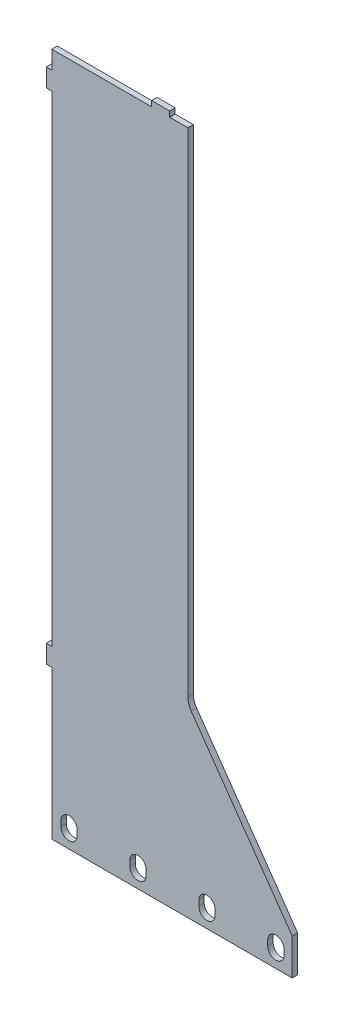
from build123d import *

# Parameters (mm, degrees)
EXTRUDE_1_DEPTH        = 3
SKETCH_2_W             = 93
SKETCH_2_H             = 3
EXTRUDE_2_DEPTH        = 132.5
FILLET_1_R             = 3
FILLET_2_R             = 6
SKETCH_3_W             = 3
SKETCH_3_H             = 64
EXTRUDE_3_DEPTH        = 132.5
FILLET_3_R             = 3
FILLET_4_R             = 6
SKETCH_4_R             = 4.5
CUT_EXTRUDE_1_DEPTH    = 354.18727327
CUT_EXTRUDE_2_DEPTH    = 354.18727327
PATTERN_LINEAR_1_COUNT = 4
PATTERN_LINEAR_1_PITCH = 38
SKETCH_8_W             = 3
SKETCH_8_H             = 10
EXTRUDE_4_DEPTH        = 3
CUT_EXTRUDE_3_DEPTH    = 354.18727327
CUT_EXTRUDE_4_DEPTH    = 354.18727327
EXTRUDE_5_DEPTH        = 3
SKETCH_12_W            = 289.518700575
SKETCH_12_H            = 417.347132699
CUT_EXTRUDE_5_DEPTH    = 93
EXTRUDE_6_DEPTH        = 3
CUT_EXTRUDE_6_DEPTH    = 340.903295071
FILLET_5_R             = 10
SKETCH_15_W            = 10
SKETCH_15_H            = 3
EXTRUDE_7_DEPTH        = 3


with BuildPart() as part:
    # Sketch 1 → Extrude 1 (new body)
    with BuildSketch(Plane.XY):
        Polygon((0, 0), (0, 313), (30, 313), (132.5, 21.5), (132.5, 0), align=None)
    extrude(amount=EXTRUDE_1_DEPTH)

    # Sketch 2 → Extrude 2 (add)
    with BuildSketch(Plane.ZY):
        with Locations((49.5, 1.5)):
            Rectangle(SKETCH_2_W, SKETCH_2_H)
    extrude(amount=-EXTRUDE_2_DEPTH)

    # Fillet 1
    fillet_1_edges = [part.edges().sort_by_distance(p)[0] for p in [
        (66.25, 3, 3),
    ]]
    fillet(fillet_1_edges, radius=FILLET_1_R)

    # Fillet 2
    fillet_2_edges = [part.edges().sort_by_distance(p)[0] for p in [
        (66.25, 0, 0),
    ]]
    fillet(fillet_2_edges, radius=FILLET_2_R)

    # Sketch 3 → Extrude 3 (add)
    with BuildSketch(Plane.ZY):
        with Locations((94.5, -32)):
            Rectangle(SKETCH_3_W, SKETCH_3_H)
    extrude(amount=-EXTRUDE_3_DEPTH)

    # Fillet 3
    fillet_3_edges = [part.edges().sort_by_distance(p)[0] for p in [
        (66.25, 0, 93),
    ]]
    fillet(fillet_3_edges, radius=FILLET_3_R)

    # Fillet 4
    fillet_4_edges = [part.edges().sort_by_distance(p)[0] for p in [
        (66.25, 3, 96),
    ]]
    fillet(fillet_4_edges, radius=FILLET_4_R)

    # Sketch 4 → Cut-Extrude 1 (cut, through all)
    with BuildSketch(Plane.XY.offset(96)):
        with Locations((9.5, -54)):
            Circle(SKETCH_4_R)
        with Locations((123.5, -54)):
            Circle(SKETCH_4_R)
        with Locations((85.5, -54)):
            Circle(SKETCH_4_R)
        with Locations((47.5, -54)):
            Circle(SKETCH_4_R)
    extrude(amount=-CUT_EXTRUDE_1_DEPTH, mode=Mode.SUBTRACT)

    # Sketch 7 → Cut-Extrude 2 (cut, through all)
    with BuildSketch(Plane.XY.offset(96)):
        with BuildLine():
            Line((14, -52.5), (14, -55.5))
            ThreePointArc((14, -55.5), (9.5, -60), (5, -55.5))
            Line((5, -55.5), (5, -52.5))
            ThreePointArc((5, -52.5), (9.5, -48), (14, -52.5))
        make_face()
    cut_extrude_2 = extrude(amount=-CUT_EXTRUDE_2_DEPTH, mode=Mode.SUBTRACT)

    # Pattern Linear 1: Cut-Extrude 2 ×4
    with Locations(*[(i * PATTERN_LINEAR_1_PITCH, 0, 0) for i in range(1, PATTERN_LINEAR_1_COUNT)]):
        add(cut_extrude_2, mode=Mode.SUBTRACT)

    # Sketch 8 → Extrude 4 (add)
    with BuildSketch(Plane(origin=(0, 0, 0), x_dir=(-1, 0, 0), z_dir=(0, 0, -1))):
        with Locations((1.5, 298)):
            Rectangle(SKETCH_8_W, SKETCH_8_H)
        with Locations((1.5, 23)):
            Rectangle(SKETCH_8_W, SKETCH_8_H)
    extrude(amount=-EXTRUDE_4_DEPTH)

    # Sketch 9 → Cut-Extrude 3 (cut, through all)
    with BuildSketch(Plane(origin=(0, 0, 0), x_dir=(-1, 0, 0), z_dir=(0, 0, -1))):
        with BuildLine():
            Line((-64.5, 21), (-64.5, 11))
            ThreePointArc((-64.5, 11), (-66, 9.5), (-67.5, 11))
            Line((-67.5, 11), (-67.5, 21))
            ThreePointArc((-67.5, 21), (-66, 22.5), (-64.5, 21))
        make_face()
        with BuildLine():
            Line((-64.5, 79), (-64.5, 69))
            ThreePointArc((-64.5, 69), (-66, 67.5), (-67.5, 69))
            Line((-67.5, 69), (-67.5, 79))
            ThreePointArc((-67.5, 79), (-66, 80.5), (-64.5, 79))
        make_face()
    extrude(amount=-CUT_EXTRUDE_3_DEPTH, mode=Mode.SUBTRACT)

    # Sketch 10 → Cut-Extrude 4 (cut, through all)
    with BuildSketch(Plane.XZ):
        with BuildLine():
            Line((67.5, 24), (67.5, 14))
            ThreePointArc((67.5, 14), (66, 12.5), (64.5, 14))
            Line((64.5, 14), (64.5, 24))
            ThreePointArc((64.5, 24), (66, 25.5), (67.5, 24))
        make_face()
        with BuildLine():
            Line((67.5, 82), (67.5, 72))
            ThreePointArc((67.5, 72), (66, 70.5), (64.5, 72))
            Line((64.5, 72), (64.5, 82))
            ThreePointArc((64.5, 82), (66, 83.5), (67.5, 82))
        make_face()
    extrude(amount=-CUT_EXTRUDE_4_DEPTH, mode=Mode.SUBTRACT)

    # Sketch 11 → Extrude 5 (add)
    with BuildSketch(Plane.XY.offset(96)):
        Polygon((132.5, -3), (0, -3), (0, 18), (-3, 18), (-3, 28), (0, 28), (0, 293), (-3, 293), (-3, 303), (0, 303), (0, 313), (30, 313), (132.5, 21.5), align=None)
    extrude(amount=-EXTRUDE_5_DEPTH)

    # Sketch 12 → Cut-Extrude 5 (cut)
    with BuildSketch(Plane(origin=(0, 0, 0), x_dir=(-1, 0, 0), z_dir=(0, 0, -1))):
        with Locations((-67.289637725, 181.448756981)):
            Rectangle(SKETCH_12_W, SKETCH_12_H)
    extrude(amount=-CUT_EXTRUDE_5_DEPTH, mode=Mode.SUBTRACT)

    # Sketch 13 → Extrude 6 (add)
    with BuildSketch(Plane.XY.offset(96)):
        Polygon((30, 313), (132.5, 21.5), (132.5, 313), align=None)
    extrude(amount=-EXTRUDE_6_DEPTH)

    # Sketch 14 → Cut-Extrude 6 (cut, through all)
    with BuildSketch(Plane.XY.offset(96)):
        Polygon((75, 313), (132.5, 313), (132.5, -44), (75, 38.118510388), align=None)
    extrude(amount=-CUT_EXTRUDE_6_DEPTH, mode=Mode.SUBTRACT)

    # Fillet 5
    fillet_5_edges = [part.edges().sort_by_distance(p)[0] for p in [
        (75, 38.118510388, 94.5),
    ]]
    fillet(fillet_5_edges, radius=FILLET_5_R)

    # Sketch 15 → Extrude 7 (add)
    with BuildSketch(Plane.XY.offset(96)):
        with Locations((60, 314.5)):
            Rectangle(SKETCH_15_W, SKETCH_15_H)
    extrude(amount=-EXTRUDE_7_DEPTH)


solid = part.part
